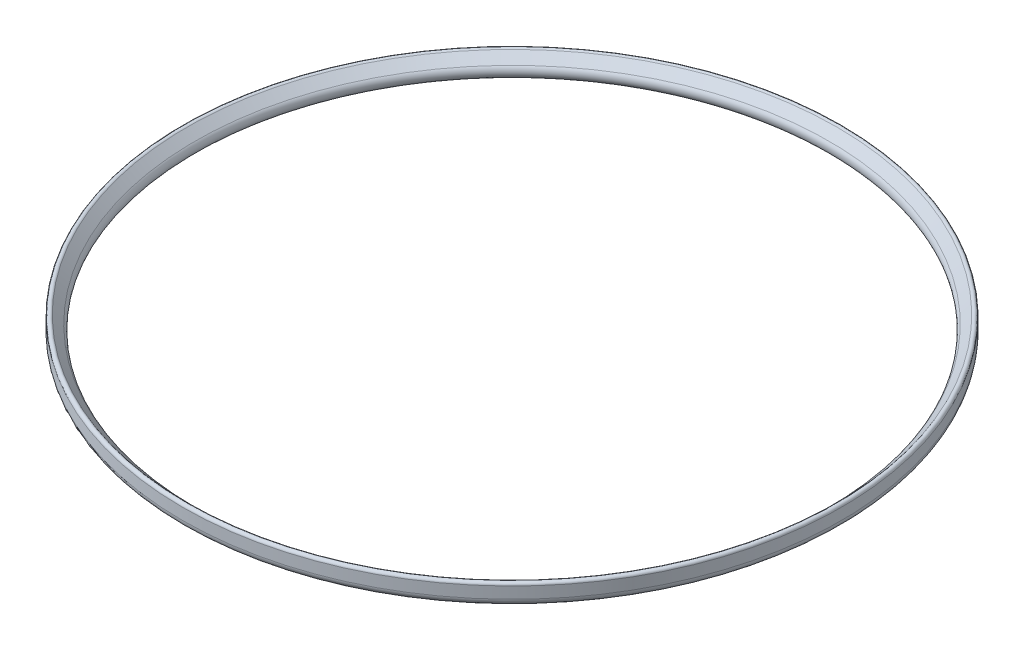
ISO-10303-21;
HEADER;
FILE_DESCRIPTION(('STEP AP214'),'2;1');
FILE_NAME('part.step','',(''),(''),'','','');
FILE_SCHEMA(('AUTOMOTIVE_DESIGN { 1 0 10303 214 1 1 1 1 }'));
ENDSEC;
DATA;
#1=APPLICATION_CONTEXT('core data for automotive mechanical design processes');
#2=APPLICATION_PROTOCOL_DEFINITION('international standard','automotive_design',2000,#1);
#3=PRODUCT_CONTEXT('',#1,'mechanical');
#4=PRODUCT('Part','Part','',(#3));
#5=PRODUCT_RELATED_PRODUCT_CATEGORY('part','',(#4));
#6=PRODUCT_DEFINITION_FORMATION('','',#4);
#7=PRODUCT_DEFINITION_CONTEXT('part definition',#1,'design');
#8=PRODUCT_DEFINITION('design','',#6,#7);
#9=PRODUCT_DEFINITION_SHAPE('','',#8);
#10=(LENGTH_UNIT() NAMED_UNIT(*) SI_UNIT(.MILLI.,.METRE.));
#11=(NAMED_UNIT(*) PLANE_ANGLE_UNIT() SI_UNIT($,.RADIAN.));
#12=(NAMED_UNIT(*) SI_UNIT($,.STERADIAN.) SOLID_ANGLE_UNIT());
#13=UNCERTAINTY_MEASURE_WITH_UNIT(LENGTH_MEASURE(1.E-05),#10,'distance_accuracy_value','');
#14=(GEOMETRIC_REPRESENTATION_CONTEXT(3) GLOBAL_UNCERTAINTY_ASSIGNED_CONTEXT((#13)) GLOBAL_UNIT_ASSIGNED_CONTEXT((#10,
#11,#12)) REPRESENTATION_CONTEXT('',''));
#15=CARTESIAN_POINT('',(0.,0.,0.));
#16=DIRECTION('',(0.,0.,1.));
#17=DIRECTION('',(1.,0.,0.));
#18=AXIS2_PLACEMENT_3D('',#15,#16,#17);
#19=CARTESIAN_POINT('',(0.,3.59289321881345,0.));
#20=DIRECTION('',(0.,1.,0.));
#21=DIRECTION('',(0.,0.,1.));
#22=AXIS2_PLACEMENT_3D('',#19,#20,#21);
#23=TOROIDAL_SURFACE('',#22,62.5,0.500000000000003);
#24=CARTESIAN_POINT('',(0.,3.59289321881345,0.));
#25=DIRECTION('',(0.,1.,0.));
#26=DIRECTION('',(0.,0.,1.));
#27=AXIS2_PLACEMENT_3D('',#24,#25,#26);
#28=CIRCLE('',#27,63.);
#29=CARTESIAN_POINT('',(0.,3.59289321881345,63.));
#30=VERTEX_POINT('',#29);
#31=EDGE_CURVE('E10',#30,#30,#28,.T.);
#32=ORIENTED_EDGE('',*,*,#31,.T.);
#33=EDGE_LOOP('',(#32));
#34=FACE_BOUND('',#33,.T.);
#35=CARTESIAN_POINT('',(0.,3.94644660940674,0.));
#36=DIRECTION('',(0.,1.,0.));
#37=DIRECTION('',(0.,0.,1.));
#38=AXIS2_PLACEMENT_3D('',#35,#36,#37);
#39=CIRCLE('',#38,62.1464466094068);
#40=CARTESIAN_POINT('',(0.,3.94644660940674,62.1464466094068));
#41=VERTEX_POINT('',#40);
#42=EDGE_CURVE('E43',#41,#41,#39,.T.);
#43=ORIENTED_EDGE('',*,*,#42,.F.);
#44=EDGE_LOOP('',(#43));
#45=FACE_BOUND('',#44,.T.);
#46=ADVANCED_FACE('F29',(#34,#45),#23,.T.);
#47=CARTESIAN_POINT('',(0.,0.,0.));
#48=DIRECTION('',(0.,1.,0.));
#49=DIRECTION('',(0.,0.,1.));
#50=AXIS2_PLACEMENT_3D('',#47,#48,#49);
#51=CYLINDRICAL_SURFACE('',#50,63.);
#52=CARTESIAN_POINT('',(0.,1.40588745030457,0.));
#53=DIRECTION('',(0.,1.,0.));
#54=DIRECTION('',(0.,0.,1.));
#55=AXIS2_PLACEMENT_3D('',#52,#53,#54);
#56=CIRCLE('',#55,63.);
#57=CARTESIAN_POINT('',(0.,1.40588745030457,63.));
#58=VERTEX_POINT('',#57);
#59=EDGE_CURVE('E35',#58,#58,#56,.T.);
#60=ORIENTED_EDGE('',*,*,#59,.T.);
#61=EDGE_LOOP('',(#60));
#62=FACE_BOUND('',#61,.T.);
#63=ORIENTED_EDGE('',*,*,#31,.F.);
#64=EDGE_LOOP('',(#63));
#65=FACE_BOUND('',#64,.T.);
#66=ADVANCED_FACE('F53',(#62,#65),#51,.T.);
#67=CARTESIAN_POINT('',(0.,1.40588745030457,0.));
#68=DIRECTION('',(0.,1.,0.));
#69=DIRECTION('',(0.,0.,1.));
#70=AXIS2_PLACEMENT_3D('',#67,#68,#69);
#71=TOROIDAL_SURFACE('',#70,61.5941125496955,1.40588745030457);
#72=CARTESIAN_POINT('',(0.,2.40000000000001,0.));
#73=DIRECTION('',(0.,1.,0.));
#74=DIRECTION('',(0.,0.,1.));
#75=AXIS2_PLACEMENT_3D('',#72,#73,#74);
#76=CIRCLE('',#75,60.6);
#77=CARTESIAN_POINT('',(0.,2.40000000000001,60.6));
#78=VERTEX_POINT('',#77);
#79=EDGE_CURVE('E39',#78,#78,#76,.T.);
#80=ORIENTED_EDGE('',*,*,#79,.T.);
#81=EDGE_LOOP('',(#80));
#82=FACE_BOUND('',#81,.T.);
#83=ORIENTED_EDGE('',*,*,#59,.F.);
#84=EDGE_LOOP('',(#83));
#85=FACE_BOUND('',#84,.T.);
#86=ADVANCED_FACE('F57',(#82,#85),#71,.T.);
#87=CARTESIAN_POINT('',(0.,2.40000000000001,0.));
#88=DIRECTION('',(0.,1.,0.));
#89=DIRECTION('',(0.,0.,1.));
#90=AXIS2_PLACEMENT_3D('',#87,#88,#89);
#91=CONICAL_SURFACE('',#90,60.6,0.785398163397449);
#92=ORIENTED_EDGE('',*,*,#42,.T.);
#93=EDGE_LOOP('',(#92));
#94=FACE_BOUND('',#93,.T.);
#95=ORIENTED_EDGE('',*,*,#79,.F.);
#96=EDGE_LOOP('',(#95));
#97=FACE_BOUND('',#96,.T.);
#98=ADVANCED_FACE('F49',(#94,#97),#91,.F.);
#99=CLOSED_SHELL('',(#46,#66,#86,#98));
#100=MANIFOLD_SOLID_BREP('B2',#99);
#101=ADVANCED_BREP_SHAPE_REPRESENTATION('',(#18,#100),#14);
#102=SHAPE_DEFINITION_REPRESENTATION(#9,#101);
ENDSEC;
END-ISO-10303-21;
